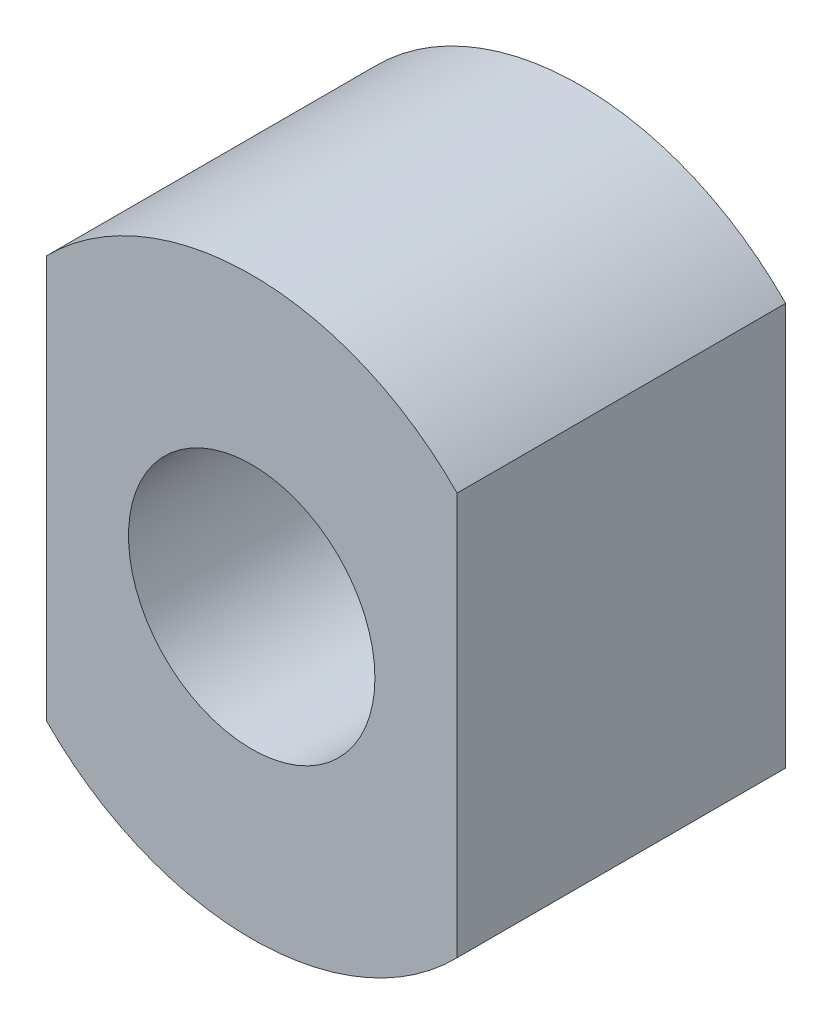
ISO-10303-21;
HEADER;
FILE_DESCRIPTION(('STEP AP214'),'2;1');
FILE_NAME('part.step','',(''),(''),'','','');
FILE_SCHEMA(('AUTOMOTIVE_DESIGN { 1 0 10303 214 1 1 1 1 }'));
ENDSEC;
DATA;
#1=APPLICATION_CONTEXT('core data for automotive mechanical design processes');
#2=APPLICATION_PROTOCOL_DEFINITION('international standard','automotive_design',2000,#1);
#3=PRODUCT_CONTEXT('',#1,'mechanical');
#4=PRODUCT('Part','Part','',(#3));
#5=PRODUCT_RELATED_PRODUCT_CATEGORY('part','',(#4));
#6=PRODUCT_DEFINITION_FORMATION('','',#4);
#7=PRODUCT_DEFINITION_CONTEXT('part definition',#1,'design');
#8=PRODUCT_DEFINITION('design','',#6,#7);
#9=PRODUCT_DEFINITION_SHAPE('','',#8);
#10=(LENGTH_UNIT() NAMED_UNIT(*) SI_UNIT(.MILLI.,.METRE.));
#11=(NAMED_UNIT(*) PLANE_ANGLE_UNIT() SI_UNIT($,.RADIAN.));
#12=(NAMED_UNIT(*) SI_UNIT($,.STERADIAN.) SOLID_ANGLE_UNIT());
#13=UNCERTAINTY_MEASURE_WITH_UNIT(LENGTH_MEASURE(1.E-05),#10,'distance_accuracy_value','');
#14=(GEOMETRIC_REPRESENTATION_CONTEXT(3) GLOBAL_UNCERTAINTY_ASSIGNED_CONTEXT((#13)) GLOBAL_UNIT_ASSIGNED_CONTEXT((#10,
#11,#12)) REPRESENTATION_CONTEXT('',''));
#15=CARTESIAN_POINT('',(0.,0.,0.));
#16=DIRECTION('',(0.,0.,1.));
#17=DIRECTION('',(1.,0.,0.));
#18=AXIS2_PLACEMENT_3D('',#15,#16,#17);
#19=CARTESIAN_POINT('',(0.,0.,4.));
#20=DIRECTION('',(0.,0.,1.));
#21=DIRECTION('',(1.,0.,0.));
#22=AXIS2_PLACEMENT_3D('',#19,#20,#21);
#23=PLANE('',#22);
#24=CARTESIAN_POINT('',(0.,0.,4.));
#25=DIRECTION('',(0.,0.,1.));
#26=DIRECTION('',(1.,0.,0.));
#27=AXIS2_PLACEMENT_3D('',#24,#25,#26);
#28=CIRCLE('',#27,3.5);
#29=CARTESIAN_POINT('',(2.5,2.44948974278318,4.));
#30=VERTEX_POINT('',#29);
#31=CARTESIAN_POINT('',(-2.5,2.44948974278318,4.));
#32=VERTEX_POINT('',#31);
#33=EDGE_CURVE('E97',#30,#32,#28,.T.);
#34=ORIENTED_EDGE('',*,*,#33,.T.);
#35=DIRECTION('',(0.,-1.,0.));
#36=VECTOR('',#35,1.);
#37=CARTESIAN_POINT('',(-2.5,2.44948974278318,4.));
#38=LINE('',#37,#36);
#39=CARTESIAN_POINT('',(-2.5,-2.44948974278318,4.));
#40=VERTEX_POINT('',#39);
#41=EDGE_CURVE('E82',#32,#40,#38,.T.);
#42=ORIENTED_EDGE('',*,*,#41,.T.);
#43=CARTESIAN_POINT('',(0.,0.,4.));
#44=DIRECTION('',(0.,0.,1.));
#45=DIRECTION('',(1.,0.,0.));
#46=AXIS2_PLACEMENT_3D('',#43,#44,#45);
#47=CIRCLE('',#46,3.5);
#48=CARTESIAN_POINT('',(2.5,-2.44948974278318,4.));
#49=VERTEX_POINT('',#48);
#50=EDGE_CURVE('E48',#40,#49,#47,.T.);
#51=ORIENTED_EDGE('',*,*,#50,.T.);
#52=DIRECTION('',(0.,1.,0.));
#53=VECTOR('',#52,1.);
#54=CARTESIAN_POINT('',(2.5,2.44948974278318,4.));
#55=LINE('',#54,#53);
#56=EDGE_CURVE('E43',#49,#30,#55,.T.);
#57=ORIENTED_EDGE('',*,*,#56,.T.);
#58=EDGE_LOOP('',(#34,#42,#51,#57));
#59=FACE_BOUND('',#58,.T.);
#60=CARTESIAN_POINT('',(0.,0.,4.));
#61=DIRECTION('',(0.,0.,1.));
#62=DIRECTION('',(1.,0.,0.));
#63=AXIS2_PLACEMENT_3D('',#60,#61,#62);
#64=CIRCLE('',#63,1.5);
#65=CARTESIAN_POINT('',(1.5,0.,4.));
#66=VERTEX_POINT('',#65);
#67=EDGE_CURVE('E87',#66,#66,#64,.T.);
#68=ORIENTED_EDGE('',*,*,#67,.F.);
#69=EDGE_LOOP('',(#68));
#70=FACE_BOUND('',#69,.T.);
#71=ADVANCED_FACE('F28',(#59,#70),#23,.T.);
#72=CARTESIAN_POINT('',(0.,0.,0.));
#73=DIRECTION('',(0.,0.,1.));
#74=DIRECTION('',(1.,0.,0.));
#75=AXIS2_PLACEMENT_3D('',#72,#73,#74);
#76=PLANE('',#75);
#77=CARTESIAN_POINT('',(0.,0.,0.));
#78=DIRECTION('',(0.,0.,1.));
#79=DIRECTION('',(1.,0.,0.));
#80=AXIS2_PLACEMENT_3D('',#77,#78,#79);
#81=CIRCLE('',#80,3.5);
#82=CARTESIAN_POINT('',(2.5,2.44948974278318,0.));
#83=VERTEX_POINT('',#82);
#84=CARTESIAN_POINT('',(-2.5,2.44948974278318,0.));
#85=VERTEX_POINT('',#84);
#86=EDGE_CURVE('E74',#83,#85,#81,.T.);
#87=ORIENTED_EDGE('',*,*,#86,.F.);
#88=DIRECTION('',(0.,1.,0.));
#89=VECTOR('',#88,1.);
#90=CARTESIAN_POINT('',(2.5,2.44948974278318,0.));
#91=LINE('',#90,#89);
#92=CARTESIAN_POINT('',(2.5,-2.44948974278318,0.));
#93=VERTEX_POINT('',#92);
#94=EDGE_CURVE('E95',#93,#83,#91,.T.);
#95=ORIENTED_EDGE('',*,*,#94,.F.);
#96=CARTESIAN_POINT('',(0.,0.,0.));
#97=DIRECTION('',(0.,0.,1.));
#98=DIRECTION('',(1.,0.,0.));
#99=AXIS2_PLACEMENT_3D('',#96,#97,#98);
#100=CIRCLE('',#99,3.5);
#101=CARTESIAN_POINT('',(-2.5,-2.44948974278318,0.));
#102=VERTEX_POINT('',#101);
#103=EDGE_CURVE('E75',#102,#93,#100,.T.);
#104=ORIENTED_EDGE('',*,*,#103,.F.);
#105=DIRECTION('',(0.,-1.,0.));
#106=VECTOR('',#105,1.);
#107=CARTESIAN_POINT('',(-2.5,2.44948974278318,0.));
#108=LINE('',#107,#106);
#109=EDGE_CURVE('E69',#85,#102,#108,.T.);
#110=ORIENTED_EDGE('',*,*,#109,.F.);
#111=EDGE_LOOP('',(#87,#95,#104,#110));
#112=FACE_BOUND('',#111,.T.);
#113=CARTESIAN_POINT('',(0.,0.,0.));
#114=DIRECTION('',(0.,0.,1.));
#115=DIRECTION('',(1.,0.,0.));
#116=AXIS2_PLACEMENT_3D('',#113,#114,#115);
#117=CIRCLE('',#116,1.5);
#118=CARTESIAN_POINT('',(1.5,0.,0.));
#119=VERTEX_POINT('',#118);
#120=EDGE_CURVE('E90',#119,#119,#117,.T.);
#121=ORIENTED_EDGE('',*,*,#120,.T.);
#122=EDGE_LOOP('',(#121));
#123=FACE_BOUND('',#122,.T.);
#124=ADVANCED_FACE('F70',(#112,#123),#76,.F.);
#125=CARTESIAN_POINT('',(0.,0.,4.));
#126=DIRECTION('',(0.,0.,-1.));
#127=DIRECTION('',(-1.,0.,0.));
#128=AXIS2_PLACEMENT_3D('',#125,#126,#127);
#129=CYLINDRICAL_SURFACE('',#128,3.5);
#130=ORIENTED_EDGE('',*,*,#86,.T.);
#131=DIRECTION('',(0.,0.,-1.));
#132=VECTOR('',#131,1.);
#133=CARTESIAN_POINT('',(-2.5,2.44948974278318,4.));
#134=LINE('',#133,#132);
#135=EDGE_CURVE('E11',#32,#85,#134,.T.);
#136=ORIENTED_EDGE('',*,*,#135,.F.);
#137=ORIENTED_EDGE('',*,*,#33,.F.);
#138=DIRECTION('',(0.,0.,-1.));
#139=VECTOR('',#138,1.);
#140=CARTESIAN_POINT('',(2.5,2.44948974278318,4.));
#141=LINE('',#140,#139);
#142=EDGE_CURVE('E86',#30,#83,#141,.T.);
#143=ORIENTED_EDGE('',*,*,#142,.T.);
#144=EDGE_LOOP('',(#130,#136,#137,#143));
#145=FACE_BOUND('',#144,.T.);
#146=ADVANCED_FACE('F30',(#145),#129,.T.);
#147=CARTESIAN_POINT('',(-2.5,2.44948974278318,4.));
#148=DIRECTION('',(1.,0.,0.));
#149=DIRECTION('',(0.,1.,0.));
#150=AXIS2_PLACEMENT_3D('',#147,#148,#149);
#151=PLANE('',#150);
#152=ORIENTED_EDGE('',*,*,#109,.T.);
#153=DIRECTION('',(0.,0.,-1.));
#154=VECTOR('',#153,1.);
#155=CARTESIAN_POINT('',(-2.5,-2.44948974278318,4.));
#156=LINE('',#155,#154);
#157=EDGE_CURVE('E36',#40,#102,#156,.T.);
#158=ORIENTED_EDGE('',*,*,#157,.F.);
#159=ORIENTED_EDGE('',*,*,#41,.F.);
#160=ORIENTED_EDGE('',*,*,#135,.T.);
#161=EDGE_LOOP('',(#152,#158,#159,#160));
#162=FACE_BOUND('',#161,.T.);
#163=ADVANCED_FACE('F81',(#162),#151,.F.);
#164=CARTESIAN_POINT('',(0.,0.,4.));
#165=DIRECTION('',(0.,0.,-1.));
#166=DIRECTION('',(-1.,0.,0.));
#167=AXIS2_PLACEMENT_3D('',#164,#165,#166);
#168=CYLINDRICAL_SURFACE('',#167,3.5);
#169=ORIENTED_EDGE('',*,*,#103,.T.);
#170=DIRECTION('',(0.,0.,-1.));
#171=VECTOR('',#170,1.);
#172=CARTESIAN_POINT('',(2.5,-2.44948974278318,4.));
#173=LINE('',#172,#171);
#174=EDGE_CURVE('E103',#49,#93,#173,.T.);
#175=ORIENTED_EDGE('',*,*,#174,.F.);
#176=ORIENTED_EDGE('',*,*,#50,.F.);
#177=ORIENTED_EDGE('',*,*,#157,.T.);
#178=EDGE_LOOP('',(#169,#175,#176,#177));
#179=FACE_BOUND('',#178,.T.);
#180=ADVANCED_FACE('F106',(#179),#168,.T.);
#181=CARTESIAN_POINT('',(2.5,2.44948974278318,4.));
#182=DIRECTION('',(-1.,0.,0.));
#183=DIRECTION('',(0.,-1.,0.));
#184=AXIS2_PLACEMENT_3D('',#181,#182,#183);
#185=PLANE('',#184);
#186=ORIENTED_EDGE('',*,*,#94,.T.);
#187=ORIENTED_EDGE('',*,*,#142,.F.);
#188=ORIENTED_EDGE('',*,*,#56,.F.);
#189=ORIENTED_EDGE('',*,*,#174,.T.);
#190=EDGE_LOOP('',(#186,#187,#188,#189));
#191=FACE_BOUND('',#190,.T.);
#192=ADVANCED_FACE('F108',(#191),#185,.F.);
#193=CARTESIAN_POINT('',(0.,0.,4.));
#194=DIRECTION('',(0.,0.,-1.));
#195=DIRECTION('',(-1.,0.,0.));
#196=AXIS2_PLACEMENT_3D('',#193,#194,#195);
#197=CYLINDRICAL_SURFACE('',#196,1.5);
#198=ORIENTED_EDGE('',*,*,#67,.T.);
#199=EDGE_LOOP('',(#198));
#200=FACE_BOUND('',#199,.T.);
#201=ORIENTED_EDGE('',*,*,#120,.F.);
#202=EDGE_LOOP('',(#201));
#203=FACE_BOUND('',#202,.T.);
#204=ADVANCED_FACE('F114',(#200,#203),#197,.F.);
#205=CLOSED_SHELL('',(#71,#124,#146,#163,#180,#192,#204));
#206=MANIFOLD_SOLID_BREP('B2',#205);
#207=ADVANCED_BREP_SHAPE_REPRESENTATION('',(#18,#206),#14);
#208=SHAPE_DEFINITION_REPRESENTATION(#9,#207);
ENDSEC;
END-ISO-10303-21;
